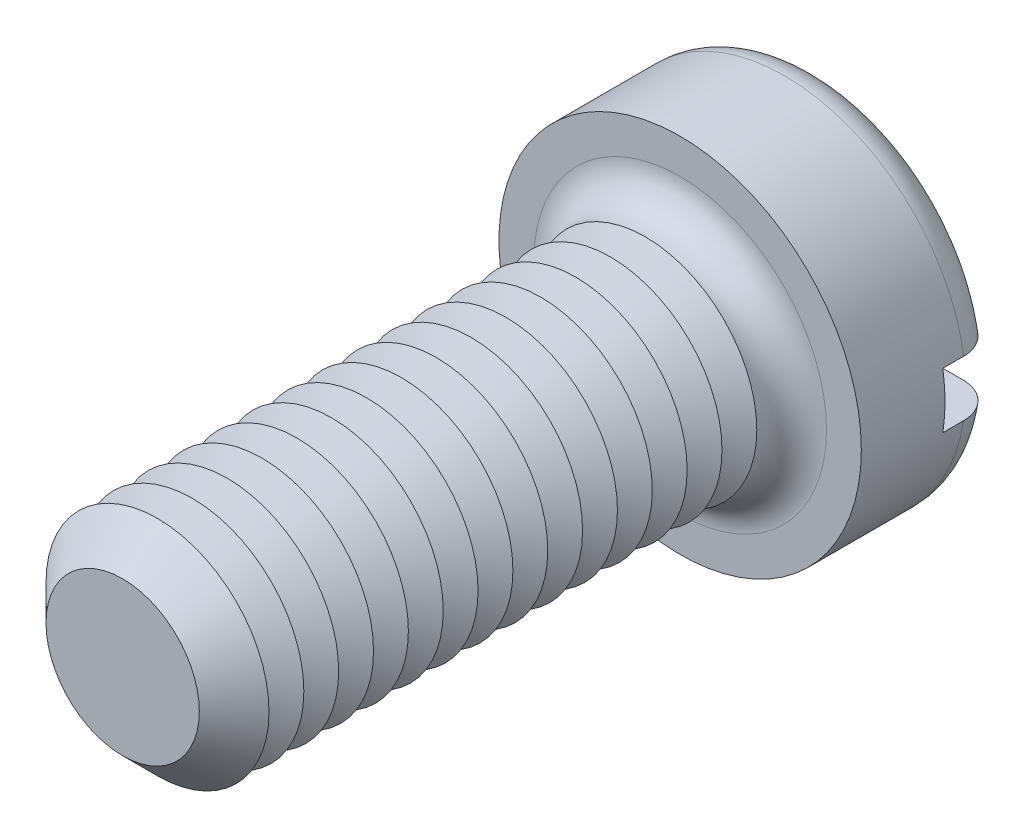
ISO-10303-21;
HEADER;
FILE_DESCRIPTION(('STEP AP214'),'2;1');
FILE_NAME('part.step','',(''),(''),'','','');
FILE_SCHEMA(('AUTOMOTIVE_DESIGN { 1 0 10303 214 1 1 1 1 }'));
ENDSEC;
DATA;
#1=APPLICATION_CONTEXT('core data for automotive mechanical design processes');
#2=APPLICATION_PROTOCOL_DEFINITION('international standard','automotive_design',2000,#1);
#3=PRODUCT_CONTEXT('',#1,'mechanical');
#4=PRODUCT('Part','Part','',(#3));
#5=PRODUCT_RELATED_PRODUCT_CATEGORY('part','',(#4));
#6=PRODUCT_DEFINITION_FORMATION('','',#4);
#7=PRODUCT_DEFINITION_CONTEXT('part definition',#1,'design');
#8=PRODUCT_DEFINITION('design','',#6,#7);
#9=PRODUCT_DEFINITION_SHAPE('','',#8);
#10=(LENGTH_UNIT() NAMED_UNIT(*) SI_UNIT(.MILLI.,.METRE.));
#11=(NAMED_UNIT(*) PLANE_ANGLE_UNIT() SI_UNIT($,.RADIAN.));
#12=(NAMED_UNIT(*) SI_UNIT($,.STERADIAN.) SOLID_ANGLE_UNIT());
#13=UNCERTAINTY_MEASURE_WITH_UNIT(LENGTH_MEASURE(1.E-05),#10,'distance_accuracy_value','');
#14=(GEOMETRIC_REPRESENTATION_CONTEXT(3) GLOBAL_UNCERTAINTY_ASSIGNED_CONTEXT((#13)) GLOBAL_UNIT_ASSIGNED_CONTEXT((#10,
#11,#12)) REPRESENTATION_CONTEXT('',''));
#15=CARTESIAN_POINT('',(0.,0.,0.));
#16=DIRECTION('',(0.,0.,1.));
#17=DIRECTION('',(1.,0.,0.));
#18=AXIS2_PLACEMENT_3D('',#15,#16,#17);
#19=CARTESIAN_POINT('',(0.,0.,-5.));
#20=DIRECTION('',(0.,0.,1.));
#21=DIRECTION('',(1.,0.,0.));
#22=AXIS2_PLACEMENT_3D('',#19,#20,#21);
#23=PLANE('',#22);
#24=CARTESIAN_POINT('',(0.,0.,-5.));
#25=DIRECTION('',(0.,0.,1.));
#26=DIRECTION('',(1.,0.,0.));
#27=AXIS2_PLACEMENT_3D('',#24,#25,#26);
#28=CIRCLE('',#27,5.25);
#29=CARTESIAN_POINT('',(-5.15388203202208,1.,-5.));
#30=VERTEX_POINT('',#29);
#31=CARTESIAN_POINT('',(5.15388203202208,1.,-5.));
#32=VERTEX_POINT('',#31);
#33=EDGE_CURVE('E116',#30,#32,#28,.F.);
#34=ORIENTED_EDGE('',*,*,#33,.T.);
#35=DIRECTION('',(1.,0.,0.));
#36=VECTOR('',#35,1.);
#37=CARTESIAN_POINT('',(-6.5,1.,-5.));
#38=LINE('',#37,#36);
#39=EDGE_CURVE('E111',#30,#32,#38,.T.);
#40=ORIENTED_EDGE('',*,*,#39,.F.);
#41=EDGE_LOOP('',(#34,#40));
#42=FACE_BOUND('',#41,.T.);
#43=ADVANCED_FACE('F39',(#42),#23,.F.);
#44=CARTESIAN_POINT('',(0.,0.,-3.75));
#45=DIRECTION('',(0.,0.,1.));
#46=DIRECTION('',(1.,0.,0.));
#47=AXIS2_PLACEMENT_3D('',#44,#45,#46);
#48=TOROIDAL_SURFACE('',#47,5.25,1.25);
#49=CARTESIAN_POINT('',(-6.04655789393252,1.,-4.63904490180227));
#50=CARTESIAN_POINT('',(-5.99546860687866,1.,-4.68885774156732));
#51=CARTESIAN_POINT('',(-5.94008472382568,1.,-4.73434760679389));
#52=CARTESIAN_POINT('',(-5.8223927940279,1.,-4.81538052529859));
#53=CARTESIAN_POINT('',(-5.7600753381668,1.,-4.85090982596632));
#54=CARTESIAN_POINT('',(-5.63044351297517,1.,-4.91100606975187));
#55=CARTESIAN_POINT('',(-5.56313479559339,1.,-4.93558519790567));
#56=CARTESIAN_POINT('',(-5.42539577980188,1.,-4.97322457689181));
#57=CARTESIAN_POINT('',(-5.35496625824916,1.,-4.98628767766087));
#58=CARTESIAN_POINT('',(-5.21212635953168,1.,-5.00070478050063));
#59=CARTESIAN_POINT('',(-5.13970265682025,1.,-5.00192674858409));
#60=CARTESIAN_POINT('',(-4.99565121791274,1.,-4.99234085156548));
#61=CARTESIAN_POINT('',(-4.92402357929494,1.,-4.98153152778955));
#62=CARTESIAN_POINT('',(-4.78274786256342,1.,-4.94801424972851));
#63=CARTESIAN_POINT('',(-4.71313137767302,1.,-4.92517296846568));
#64=CARTESIAN_POINT('',(-4.57871041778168,1.,-4.86813760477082));
#65=CARTESIAN_POINT('',(-4.51390612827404,1.,-4.83394308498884));
#66=CARTESIAN_POINT('',(-4.39095493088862,1.,-4.75508341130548));
#67=CARTESIAN_POINT('',(-4.33281197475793,1.,-4.7104120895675));
#68=CARTESIAN_POINT('',(-4.22499800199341,1.,-4.61179869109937));
#69=CARTESIAN_POINT('',(-4.17532640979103,1.,-4.55785724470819));
#70=CARTESIAN_POINT('',(-4.08677450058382,1.,-4.4431082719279));
#71=CARTESIAN_POINT('',(-4.0477350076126,1.,-4.38242369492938));
#72=CARTESIAN_POINT('',(-3.98074296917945,1.,-4.25521412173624));
#73=CARTESIAN_POINT('',(-3.95278836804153,1.,-4.18869021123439));
#74=CARTESIAN_POINT('',(-3.90959497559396,1.,-4.0537026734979));
#75=CARTESIAN_POINT('',(-3.89401985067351,1.,-3.98534663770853));
#76=CARTESIAN_POINT('',(-3.8748586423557,1.,-3.84697740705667));
#77=CARTESIAN_POINT('',(-3.87127067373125,1.,-3.7769644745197));
#78=CARTESIAN_POINT('',(-3.8761573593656,1.,-3.63892215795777));
#79=CARTESIAN_POINT('',(-3.88436651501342,1.,-3.57088319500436));
#80=CARTESIAN_POINT('',(-3.91207743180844,1.,-3.43714958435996));
#81=CARTESIAN_POINT('',(-3.93157911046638,1.,-3.37145491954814));
#82=CARTESIAN_POINT('',(-3.98125045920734,1.,-3.24411474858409));
#83=CARTESIAN_POINT('',(-4.01143761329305,1.,-3.18247607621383));
#84=CARTESIAN_POINT('',(-4.08150210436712,1.,-3.064981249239));
#85=CARTESIAN_POINT('',(-4.12138048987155,1.,-3.0091257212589));
#86=CARTESIAN_POINT('',(-4.2106718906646,1.,-2.90336353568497));
#87=CARTESIAN_POINT('',(-4.26028693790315,1.,-2.85362751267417));
#88=CARTESIAN_POINT('',(-4.36696587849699,1.,-2.76291710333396));
#89=CARTESIAN_POINT('',(-4.42403082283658,1.,-2.72194395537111));
#90=CARTESIAN_POINT('',(-4.54567957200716,1.,-2.64877280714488));
#91=CARTESIAN_POINT('',(-4.61042643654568,1.,-2.61684571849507));
#92=CARTESIAN_POINT('',(-4.74430563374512,1.,-2.56412359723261));
#93=CARTESIAN_POINT('',(-4.81343838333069,1.,-2.54332962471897));
#94=CARTESIAN_POINT('',(-4.95527237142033,1.,-2.51320471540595));
#95=CARTESIAN_POINT('',(-5.0280120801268,1.,-2.50405449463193));
#96=CARTESIAN_POINT('',(-5.17399775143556,1.,-2.49810126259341));
#97=CARTESIAN_POINT('',(-5.24724372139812,1.,-2.50129843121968));
#98=CARTESIAN_POINT('',(-5.3921014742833,1.,-2.52000776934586));
#99=CARTESIAN_POINT('',(-5.4637142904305,1.,-2.53551191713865));
#100=CARTESIAN_POINT('',(-5.60326680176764,1.,-2.57846304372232));
#101=CARTESIAN_POINT('',(-5.67120668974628,1.,-2.60590939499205));
#102=CARTESIAN_POINT('',(-5.80064060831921,1.,-2.67164926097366));
#103=CARTESIAN_POINT('',(-5.862199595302,1.,-2.7098148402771));
#104=CARTESIAN_POINT('',(-5.9779079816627,1.,-2.79608690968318));
#105=CARTESIAN_POINT('',(-6.03205795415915,1.,-2.84419263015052));
#106=CARTESIAN_POINT('',(-6.13055119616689,1.,-2.94820522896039));
#107=CARTESIAN_POINT('',(-6.17502887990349,1.,-3.00398483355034));
#108=CARTESIAN_POINT('',(-6.25384180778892,1.,-3.12230113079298));
#109=CARTESIAN_POINT('',(-6.28817779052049,1.,-3.18483733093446));
#110=CARTESIAN_POINT('',(-6.34527986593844,1.,-3.31401726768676));
#111=CARTESIAN_POINT('',(-6.36818984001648,1.,-3.38059742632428));
#112=CARTESIAN_POINT('',(-6.40240470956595,1.,-3.5166725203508));
#113=CARTESIAN_POINT('',(-6.41371067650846,1.,-3.58616718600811));
#114=CARTESIAN_POINT('',(-6.42433240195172,1.,-3.72550026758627));
#115=CARTESIAN_POINT('',(-6.4237441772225,1.,-3.79533138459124));
#116=CARTESIAN_POINT('',(-6.41082814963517,1.,-3.93391789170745));
#117=CARTESIAN_POINT('',(-6.39849757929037,1.,-4.00267302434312));
#118=CARTESIAN_POINT('',(-6.36249191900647,1.,-4.13704597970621));
#119=CARTESIAN_POINT('',(-6.33883072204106,1.,-4.20266753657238));
#120=CARTESIAN_POINT('',(-6.28088769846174,1.,-4.32897165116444));
#121=CARTESIAN_POINT('',(-6.24661890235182,1.,-4.38966015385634));
#122=CARTESIAN_POINT('',(-6.18404039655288,1.,-4.48163773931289));
#123=CARTESIAN_POINT('',(-6.15876600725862,1.,-4.51503333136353));
#124=CARTESIAN_POINT('',(-6.10500607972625,1.,-4.5791298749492));
#125=CARTESIAN_POINT('',(-6.07652056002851,1.,-4.60983084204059));
#126=CARTESIAN_POINT('',(-6.04655789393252,1.,-4.63904490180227));
#127=B_SPLINE_CURVE_WITH_KNOTS('',3,(#49,#50,#51,#52,#53,#54,#55,#56,#57,#58,#59,#60,#61,#62,
#63,#64,#65,#66,#67,#68,#69,#70,#71,#72,#73,#74,#75,#76,#77,#78,#79,#80,#81,#82,#83,#84,#85,#86,
#87,#88,#89,#90,#91,#92,#93,#94,#95,#96,#97,#98,#99,#100,#101,#102,#103,#104,#105,#106,#107,
#108,#109,#110,#111,#112,#113,#114,#115,#116,#117,#118,#119,#120,#121,#122,#123,#124,#125,#126),
.UNSPECIFIED.,.T.,.F.,(4,2,2,2,2,2,2,2,2,2,2,2,2,2,2,2,2,2,2,2,2,2,2,2,2,2,2,2,2,2,2,2,2,2,2,2,
2,2,4),(0.,0.213907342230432,0.428108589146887,0.642070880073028,0.855980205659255,
1.07227200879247,1.28859003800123,1.50735715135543,1.72613269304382,1.94503735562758,
2.16392713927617,2.37933295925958,2.59469881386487,2.80399176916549,3.01325180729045,
3.2178754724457,3.42249764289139,3.62745618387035,3.83243690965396,4.04223444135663,
4.25206160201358,4.46763253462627,4.68322399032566,4.90212226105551,5.12102372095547,
5.33978261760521,5.55853002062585,5.77477015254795,5.99099354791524,6.20398686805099,
6.41696467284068,6.62718821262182,6.83739233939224,7.0459002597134,7.25445733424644,
7.46275934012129,7.67080647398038,7.79625882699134,7.92171045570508),.UNSPECIFIED.);
#128=CARTESIAN_POINT('',(-6.42261628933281,1.,-3.74999999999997));
#129=VERTEX_POINT('',#128);
#130=EDGE_CURVE('E291',#129,#30,#127,.T.);
#131=ORIENTED_EDGE('',*,*,#130,.F.);
#132=CARTESIAN_POINT('',(0.,0.,-3.75));
#133=DIRECTION('',(0.,0.,1.));
#134=DIRECTION('',(1.,0.,0.));
#135=AXIS2_PLACEMENT_3D('',#132,#133,#134);
#136=CIRCLE('',#135,6.5);
#137=CARTESIAN_POINT('',(6.42261628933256,1.,-3.75));
#138=VERTEX_POINT('',#137);
#139=EDGE_CURVE('E125',#138,#129,#136,.T.);
#140=ORIENTED_EDGE('',*,*,#139,.F.);
#141=CARTESIAN_POINT('',(4.06944999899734,1.,-4.4133199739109));
#142=CARTESIAN_POINT('',(4.10828271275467,1.,-4.47354709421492));
#143=CARTESIAN_POINT('',(4.15233880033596,1.,-4.53047894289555));
#144=CARTESIAN_POINT('',(4.24946916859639,1.,-4.63614530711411));
#145=CARTESIAN_POINT('',(4.3025574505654,1.,-4.68486685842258));
#146=CARTESIAN_POINT('',(4.41603250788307,1.,-4.77271114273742));
#147=CARTESIAN_POINT('',(4.47640839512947,1.,-4.8118479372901));
#148=CARTESIAN_POINT('',(4.60277035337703,1.,-4.87959878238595));
#149=CARTESIAN_POINT('',(4.66875480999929,1.,-4.90821584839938));
#150=CARTESIAN_POINT('',(4.80558589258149,1.,-4.95456537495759));
#151=CARTESIAN_POINT('',(4.87649196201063,1.,-4.97212253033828));
#152=CARTESIAN_POINT('',(5.02024710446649,1.,-4.99514979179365));
#153=CARTESIAN_POINT('',(5.09309636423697,1.,-5.00061873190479));
#154=CARTESIAN_POINT('',(5.23902872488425,1.,-4.99926689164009));
#155=CARTESIAN_POINT('',(5.31211131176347,1.,-4.99238812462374));
#156=CARTESIAN_POINT('',(5.45605806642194,1.,-4.96635140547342));
#157=CARTESIAN_POINT('',(5.52692231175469,1.,-4.94719388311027));
#158=CARTESIAN_POINT('',(5.66376170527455,1.,-4.89728421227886));
#159=CARTESIAN_POINT('',(5.72977335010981,1.,-4.86663219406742));
#160=CARTESIAN_POINT('',(5.85560715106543,1.,-4.79452334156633));
#161=CARTESIAN_POINT('',(5.91542977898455,1.,-4.7530673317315));
#162=CARTESIAN_POINT('',(6.02626022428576,1.,-4.66116821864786));
#163=CARTESIAN_POINT('',(6.07738307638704,1.,-4.6108638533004));
#164=CARTESIAN_POINT('',(6.17030947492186,1.,-4.50227823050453));
#165=CARTESIAN_POINT('',(6.2121137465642,1.,-4.44399759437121));
#166=CARTESIAN_POINT('',(6.28460268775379,1.,-4.32200305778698));
#167=CARTESIAN_POINT('',(6.31543589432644,1.,-4.2583773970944));
#168=CARTESIAN_POINT('',(6.36586009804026,1.,-4.12681721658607));
#169=CARTESIAN_POINT('',(6.38545178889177,1.,-4.0588829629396));
#170=CARTESIAN_POINT('',(6.41265760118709,1.,-3.92136007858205));
#171=CARTESIAN_POINT('',(6.42038873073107,1.,-3.85179457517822));
#172=CARTESIAN_POINT('',(6.42401070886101,1.,-3.7123569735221));
#173=CARTESIAN_POINT('',(6.41990193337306,1.,-3.64248488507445));
#174=CARTESIAN_POINT('',(6.40000894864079,1.,-3.50470871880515));
#175=CARTESIAN_POINT('',(6.38427119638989,1.,-3.43679792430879));
#176=CARTESIAN_POINT('',(6.34164491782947,1.,-3.30457296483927));
#177=CARTESIAN_POINT('',(6.31475638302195,1.,-3.24025880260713));
#178=CARTESIAN_POINT('',(6.2505455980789,1.,-3.11686791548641));
#179=CARTESIAN_POINT('',(6.21319759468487,1.,-3.05780459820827));
#180=CARTESIAN_POINT('',(6.12919411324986,1.,-2.94671919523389));
#181=CARTESIAN_POINT('',(6.08253833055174,1.,-2.89469734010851));
#182=CARTESIAN_POINT('',(5.98083387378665,1.,-2.79868150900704));
#183=CARTESIAN_POINT('',(5.92571704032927,1.,-2.75475975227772));
#184=CARTESIAN_POINT('',(5.80897194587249,1.,-2.67665277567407));
#185=CARTESIAN_POINT('',(5.74734329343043,1.,-2.64246814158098));
#186=CARTESIAN_POINT('',(5.6184644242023,1.,-2.58431810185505));
#187=CARTESIAN_POINT('',(5.55115102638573,1.,-2.56049275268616));
#188=CARTESIAN_POINT('',(5.41351272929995,1.,-2.52429868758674));
#189=CARTESIAN_POINT('',(5.34318759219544,1.,-2.51193087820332));
#190=CARTESIAN_POINT('',(5.20041507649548,1.,-2.49882112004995));
#191=CARTESIAN_POINT('',(5.12795169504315,1.,-2.49825332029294));
#192=CARTESIAN_POINT('',(4.98393373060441,1.,-2.50914771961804));
#193=CARTESIAN_POINT('',(4.91237921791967,1.,-2.52061084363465));
#194=CARTESIAN_POINT('',(4.77137358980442,1.,-2.55542281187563));
#195=CARTESIAN_POINT('',(4.70195472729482,1.,-2.57890245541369));
#196=CARTESIAN_POINT('',(4.56803538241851,1.,-2.63717701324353));
#197=CARTESIAN_POINT('',(4.50353509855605,1.,-2.67197238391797));
#198=CARTESIAN_POINT('',(4.38131858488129,1.,-2.7519648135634));
#199=CARTESIAN_POINT('',(4.32360365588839,1.,-2.79716386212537));
#200=CARTESIAN_POINT('',(4.21673400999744,1.,-2.89675634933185));
#201=CARTESIAN_POINT('',(4.16757871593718,1.,-2.95114916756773));
#202=CARTESIAN_POINT('',(4.08014713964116,1.,-3.06667703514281));
#203=CARTESIAN_POINT('',(4.04170608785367,1.,-3.12768727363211));
#204=CARTESIAN_POINT('',(3.97596192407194,1.,-3.25543782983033));
#205=CARTESIAN_POINT('',(3.94865624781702,1.,-3.32217682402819));
#206=CARTESIAN_POINT('',(3.9067737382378,1.,-3.45745603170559));
#207=CARTESIAN_POINT('',(3.89185707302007,1.,-3.52589108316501));
#208=CARTESIAN_POINT('',(3.87400755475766,1.,-3.66432360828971));
#209=CARTESIAN_POINT('',(3.87107601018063,1.,-3.73432125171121));
#210=CARTESIAN_POINT('',(3.8772387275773,1.,-3.87228267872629));
#211=CARTESIAN_POINT('',(3.88607933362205,1.,-3.94025811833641));
#212=CARTESIAN_POINT('',(3.91502769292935,1.,-4.07370133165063));
#213=CARTESIAN_POINT('',(3.93512131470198,1.,-4.1391721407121));
#214=CARTESIAN_POINT('',(3.9752037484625,1.,-4.23926719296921));
#215=CARTESIAN_POINT('',(3.99171171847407,1.,-4.27532618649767));
#216=CARTESIAN_POINT('',(4.02809737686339,1.,-4.34569933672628));
#217=CARTESIAN_POINT('',(4.04797497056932,1.,-4.3800135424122));
#218=CARTESIAN_POINT('',(4.06944999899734,1.,-4.4133199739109));
#219=B_SPLINE_CURVE_WITH_KNOTS('',3,(#141,#142,#143,#144,#145,#146,#147,#148,#149,#150,#151,
#152,#153,#154,#155,#156,#157,#158,#159,#160,#161,#162,#163,#164,#165,#166,#167,#168,#169,#170,
#171,#172,#173,#174,#175,#176,#177,#178,#179,#180,#181,#182,#183,#184,#185,#186,#187,#188,#189,
#190,#191,#192,#193,#194,#195,#196,#197,#198,#199,#200,#201,#202,#203,#204,#205,#206,#207,#208,
#209,#210,#211,#212,#213,#214,#215,#216,#217,#218),.UNSPECIFIED.,.T.,.F.,(4,2,2,2,2,2,2,2,2,2,2,
2,2,2,2,2,2,2,2,2,2,2,2,2,2,2,2,2,2,2,2,2,2,2,2,2,2,2,4),(0.,0.214833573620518,
0.430003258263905,0.644855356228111,0.859645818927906,1.0777603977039,1.29589601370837,
1.51505870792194,1.73421373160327,1.95150241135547,2.16877451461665,2.38290237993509,
2.59701357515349,2.8081044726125,3.01918234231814,3.22816416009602,3.43713934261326,
3.64528416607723,3.85342914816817,4.06209119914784,4.27076008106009,4.48120788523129,
4.69166834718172,4.90489186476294,5.11813225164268,5.33451752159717,5.55091942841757,
5.76972860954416,5.98854661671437,6.20740650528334,6.42625163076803,6.64151774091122,
6.85673425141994,7.0658317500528,7.27495207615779,7.47963858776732,7.68406862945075,
7.80287790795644,7.92168384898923),.UNSPECIFIED.);
#220=EDGE_CURVE('E293',#32,#138,#219,.T.);
#221=ORIENTED_EDGE('',*,*,#220,.F.);
#222=ORIENTED_EDGE('',*,*,#33,.F.);
#223=EDGE_LOOP('',(#131,#140,#221,#222));
#224=FACE_BOUND('',#223,.T.);
#225=ADVANCED_FACE('F275',(#224),#48,.T.);
#226=CARTESIAN_POINT('',(0.,0.,-5.));
#227=DIRECTION('',(0.,0.,1.));
#228=DIRECTION('',(1.,0.,0.));
#229=AXIS2_PLACEMENT_3D('',#226,#227,#228);
#230=CYLINDRICAL_SURFACE('',#229,6.5);
#231=DIRECTION('',(0.,0.,1.));
#232=VECTOR('',#231,1.);
#233=CARTESIAN_POINT('',(6.42261628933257,1.,-5.));
#234=LINE('',#233,#232);
#235=CARTESIAN_POINT('',(6.42261628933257,1.,-3.));
#236=VERTEX_POINT('',#235);
#237=EDGE_CURVE('E308',#138,#236,#234,.T.);
#238=ORIENTED_EDGE('',*,*,#237,.F.);
#239=ORIENTED_EDGE('',*,*,#139,.T.);
#240=DIRECTION('',(0.,0.,1.));
#241=VECTOR('',#240,1.);
#242=CARTESIAN_POINT('',(-6.42261628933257,1.,-5.));
#243=LINE('',#242,#241);
#244=CARTESIAN_POINT('',(-6.42261628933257,1.,-3.));
#245=VERTEX_POINT('',#244);
#246=EDGE_CURVE('E63',#245,#129,#243,.F.);
#247=ORIENTED_EDGE('',*,*,#246,.F.);
#248=CARTESIAN_POINT('',(0.,0.,-3.));
#249=DIRECTION('',(0.,0.,-1.));
#250=DIRECTION('',(-1.,0.,0.));
#251=AXIS2_PLACEMENT_3D('',#248,#249,#250);
#252=CIRCLE('',#251,6.5);
#253=CARTESIAN_POINT('',(-6.42261628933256,-0.999999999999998,-3.));
#254=VERTEX_POINT('',#253);
#255=EDGE_CURVE('E43',#245,#254,#252,.F.);
#256=ORIENTED_EDGE('',*,*,#255,.T.);
#257=DIRECTION('',(0.,0.,1.));
#258=VECTOR('',#257,1.);
#259=CARTESIAN_POINT('',(-6.42261628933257,-0.999999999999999,-5.));
#260=LINE('',#259,#258);
#261=CARTESIAN_POINT('',(-6.42261628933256,-0.999999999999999,-3.75));
#262=VERTEX_POINT('',#261);
#263=EDGE_CURVE('E305',#262,#254,#260,.T.);
#264=ORIENTED_EDGE('',*,*,#263,.F.);
#265=CARTESIAN_POINT('',(6.42261628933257,-1.,-3.75));
#266=VERTEX_POINT('',#265);
#267=EDGE_CURVE('E127',#262,#266,#136,.T.);
#268=ORIENTED_EDGE('',*,*,#267,.T.);
#269=DIRECTION('',(0.,0.,1.));
#270=VECTOR('',#269,1.);
#271=CARTESIAN_POINT('',(6.42261628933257,-1.,-5.));
#272=LINE('',#271,#270);
#273=CARTESIAN_POINT('',(6.42261628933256,-1.,-3.));
#274=VERTEX_POINT('',#273);
#275=EDGE_CURVE('E55',#274,#266,#272,.F.);
#276=ORIENTED_EDGE('',*,*,#275,.F.);
#277=EDGE_CURVE('E11',#274,#236,#252,.F.);
#278=ORIENTED_EDGE('',*,*,#277,.T.);
#279=EDGE_LOOP('',(#238,#239,#247,#256,#264,#268,#276,#278));
#280=FACE_BOUND('',#279,.T.);
#281=CARTESIAN_POINT('',(0.,0.,0.));
#282=DIRECTION('',(0.,0.,1.));
#283=DIRECTION('',(1.,0.,0.));
#284=AXIS2_PLACEMENT_3D('',#281,#282,#283);
#285=CIRCLE('',#284,6.5);
#286=CARTESIAN_POINT('',(6.5,0.,0.));
#287=VERTEX_POINT('',#286);
#288=EDGE_CURVE('E311',#287,#287,#285,.T.);
#289=ORIENTED_EDGE('',*,*,#288,.F.);
#290=EDGE_LOOP('',(#289));
#291=FACE_BOUND('',#290,.T.);
#292=ADVANCED_FACE('F271',(#280,#291),#230,.T.);
#293=CARTESIAN_POINT('',(5.15388203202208,-1.,-5.));
#294=VERTEX_POINT('',#293);
#295=CARTESIAN_POINT('',(-5.15388203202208,-0.999999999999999,-5.));
#296=VERTEX_POINT('',#295);
#297=EDGE_CURVE('E109',#294,#296,#28,.F.);
#298=ORIENTED_EDGE('',*,*,#297,.T.);
#299=DIRECTION('',(-1.,0.,0.));
#300=VECTOR('',#299,1.);
#301=CARTESIAN_POINT('',(-6.5,-0.999999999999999,-5.));
#302=LINE('',#301,#300);
#303=EDGE_CURVE('E96',#294,#296,#302,.T.);
#304=ORIENTED_EDGE('',*,*,#303,.F.);
#305=EDGE_LOOP('',(#298,#304));
#306=FACE_BOUND('',#305,.T.);
#307=ADVANCED_FACE('F108',(#306),#23,.F.);
#308=CARTESIAN_POINT('',(0.,0.,0.));
#309=DIRECTION('',(0.,0.,1.));
#310=DIRECTION('',(1.,0.,0.));
#311=AXIS2_PLACEMENT_3D('',#308,#309,#310);
#312=PLANE('',#311);
#313=CARTESIAN_POINT('',(0.,0.,0.));
#314=DIRECTION('',(0.,0.,1.));
#315=DIRECTION('',(1.,0.,0.));
#316=AXIS2_PLACEMENT_3D('',#313,#314,#315);
#317=CIRCLE('',#316,5.25);
#318=CARTESIAN_POINT('',(5.25,0.,0.));
#319=VERTEX_POINT('',#318);
#320=EDGE_CURVE('E115',#319,#319,#317,.F.);
#321=ORIENTED_EDGE('',*,*,#320,.T.);
#322=EDGE_LOOP('',(#321));
#323=FACE_BOUND('',#322,.T.);
#324=ORIENTED_EDGE('',*,*,#288,.T.);
#325=EDGE_LOOP('',(#324));
#326=FACE_BOUND('',#325,.T.);
#327=ADVANCED_FACE('F270',(#323,#326),#312,.T.);
#328=CARTESIAN_POINT('',(-6.04655789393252,-0.999999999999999,-4.63904490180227));
#329=CARTESIAN_POINT('',(-6.0966604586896,-0.999999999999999,-4.59018532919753));
#330=CARTESIAN_POINT('',(-6.14270501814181,-0.999999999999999,-4.53709744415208));
#331=CARTESIAN_POINT('',(-6.22528519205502,-0.999999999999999,-4.42391631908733));
#332=CARTESIAN_POINT('',(-6.26181074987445,-0.999999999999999,-4.36381576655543));
#333=CARTESIAN_POINT('',(-6.32422109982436,-0.999999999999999,-4.23831836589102));
#334=CARTESIAN_POINT('',(-6.35010658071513,-0.999999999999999,-4.17292186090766));
#335=CARTESIAN_POINT('',(-6.39044668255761,-0.999999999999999,-4.03870925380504));
#336=CARTESIAN_POINT('',(-6.40490396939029,-0.999999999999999,-3.96989395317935));
#337=CARTESIAN_POINT('',(-6.42190814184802,-0.999999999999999,-3.83122595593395));
#338=CARTESIAN_POINT('',(-6.4245257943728,-0.999999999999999,-3.76138193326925));
#339=CARTESIAN_POINT('',(-6.41796432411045,-0.999999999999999,-3.62224935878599));
#340=CARTESIAN_POINT('',(-6.40878509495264,-0.999999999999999,-3.55296081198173));
#341=CARTESIAN_POINT('',(-6.37894560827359,-0.999999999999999,-3.41709241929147));
#342=CARTESIAN_POINT('',(-6.35831520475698,-0.999999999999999,-3.35050601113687));
#343=CARTESIAN_POINT('',(-6.30620980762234,-0.999999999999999,-3.22172312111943));
#344=CARTESIAN_POINT('',(-6.2747347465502,-0.999999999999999,-3.15952666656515));
#345=CARTESIAN_POINT('',(-6.20172710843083,-0.999999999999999,-3.04101762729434));
#346=CARTESIAN_POINT('',(-6.16015622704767,-0.999999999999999,-2.98472864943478));
#347=CARTESIAN_POINT('',(-6.06823774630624,-0.999999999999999,-2.87984578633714));
#348=CARTESIAN_POINT('',(-6.01788981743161,-0.999999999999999,-2.83125219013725));
#349=CARTESIAN_POINT('',(-5.90933830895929,-0.999999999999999,-2.74262118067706));
#350=CARTESIAN_POINT('',(-5.85106338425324,-0.999999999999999,-2.70267117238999));
#351=CARTESIAN_POINT('',(-5.72870702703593,-0.999999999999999,-2.63296796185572));
#352=CARTESIAN_POINT('',(-5.66462521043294,-0.999999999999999,-2.6032154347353));
#353=CARTESIAN_POINT('',(-5.53153273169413,-0.999999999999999,-2.55430842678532));
#354=CARTESIAN_POINT('',(-5.46246626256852,-0.999999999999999,-2.53530583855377));
#355=CARTESIAN_POINT('',(-5.32214267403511,-0.999999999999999,-2.5089831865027));
#356=CARTESIAN_POINT('',(-5.25088537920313,-0.999999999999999,-2.50166406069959));
#357=CARTESIAN_POINT('',(-5.10710123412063,-0.999999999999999,-2.49882202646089));
#358=CARTESIAN_POINT('',(-5.03457095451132,-0.999999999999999,-2.50347166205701));
#359=CARTESIAN_POINT('',(-4.8912897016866,-0.999999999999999,-2.52476029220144));
#360=CARTESIAN_POINT('',(-4.82053886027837,-0.999999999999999,-2.54140017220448));
#361=CARTESIAN_POINT('',(-4.68213257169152,-0.999999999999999,-2.58641614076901));
#362=CARTESIAN_POINT('',(-4.61451256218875,-0.999999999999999,-2.61490131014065));
#363=CARTESIAN_POINT('',(-4.48502801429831,-0.999999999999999,-2.68285095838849));
#364=CARTESIAN_POINT('',(-4.42316359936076,-0.999999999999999,-2.72231567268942));
#365=CARTESIAN_POINT('',(-4.30720694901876,-0.999999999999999,-2.81103994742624));
#366=CARTESIAN_POINT('',(-4.25309118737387,-0.999999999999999,-2.86026872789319));
#367=CARTESIAN_POINT('',(-4.15409408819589,-0.999999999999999,-2.9672764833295));
#368=CARTESIAN_POINT('',(-4.10921182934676,-0.999999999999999,-3.02505460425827));
#369=CARTESIAN_POINT('',(-4.03096584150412,-0.999999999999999,-3.14632492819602));
#370=CARTESIAN_POINT('',(-3.99739097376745,-0.999999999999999,-3.2096807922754));
#371=CARTESIAN_POINT('',(-3.94171839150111,-0.999999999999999,-3.34124912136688));
#372=CARTESIAN_POINT('',(-3.91961840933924,-0.999999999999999,-3.40946062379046));
#373=CARTESIAN_POINT('',(-3.88816636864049,-0.999999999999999,-3.54669256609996));
#374=CARTESIAN_POINT('',(-3.87846562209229,-0.999999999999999,-3.61563318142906));
#375=CARTESIAN_POINT('',(-3.87100568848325,-0.999999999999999,-3.75415397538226));
#376=CARTESIAN_POINT('',(-3.87324501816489,-0.999999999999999,-3.82373407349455));
#377=CARTESIAN_POINT('',(-3.88943589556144,-0.999999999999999,-3.96027701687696));
#378=CARTESIAN_POINT('',(-3.90318225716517,-0.999999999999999,-4.0272643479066));
#379=CARTESIAN_POINT('',(-3.94163954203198,-0.999999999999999,-4.1580093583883));
#380=CARTESIAN_POINT('',(-3.96635075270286,-0.999999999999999,-4.22176695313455));
#381=CARTESIAN_POINT('',(-4.026160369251,-0.999999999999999,-4.34483320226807));
#382=CARTESIAN_POINT('',(-4.06134035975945,-0.999999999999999,-4.40410214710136));
#383=CARTESIAN_POINT('',(-4.14090865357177,-0.999999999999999,-4.51609417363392));
#384=CARTESIAN_POINT('',(-4.18529811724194,-0.999999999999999,-4.56881642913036));
#385=CARTESIAN_POINT('',(-4.2832649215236,-0.999999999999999,-4.66770177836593));
#386=CARTESIAN_POINT('',(-4.33705327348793,-0.999999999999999,-4.71365579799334));
#387=CARTESIAN_POINT('',(-4.45141776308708,-0.999999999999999,-4.79615385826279));
#388=CARTESIAN_POINT('',(-4.51199483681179,-0.999999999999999,-4.83269659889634));
#389=CARTESIAN_POINT('',(-4.63989216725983,-0.999999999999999,-4.89626962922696));
#390=CARTESIAN_POINT('',(-4.70734508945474,-0.999999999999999,-4.92303326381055));
#391=CARTESIAN_POINT('',(-4.84575497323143,-0.999999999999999,-4.96500199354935));
#392=CARTESIAN_POINT('',(-4.91671207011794,-0.999999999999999,-4.98020664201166));
#393=CARTESIAN_POINT('',(-5.06097761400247,-0.999999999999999,-4.9987306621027));
#394=CARTESIAN_POINT('',(-5.13430353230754,-0.999999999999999,-5.00191441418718));
#395=CARTESIAN_POINT('',(-5.28046546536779,-0.999999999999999,-4.99587686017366));
#396=CARTESIAN_POINT('',(-5.35330135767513,-0.999999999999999,-4.98665256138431));
#397=CARTESIAN_POINT('',(-5.49610354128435,-0.999999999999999,-4.95604184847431));
#398=CARTESIAN_POINT('',(-5.56607890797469,-0.999999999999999,-4.93469772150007));
#399=CARTESIAN_POINT('',(-5.70131538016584,-0.999999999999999,-4.88041956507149));
#400=CARTESIAN_POINT('',(-5.76658233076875,-0.999999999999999,-4.84750021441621));
#401=CARTESIAN_POINT('',(-5.86782577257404,-0.999999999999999,-4.78498748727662));
#402=CARTESIAN_POINT('',(-5.90579749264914,-0.999999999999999,-4.75856648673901));
#403=CARTESIAN_POINT('',(-5.97862186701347,-0.999999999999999,-4.70172646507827));
#404=CARTESIAN_POINT('',(-6.0134745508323,-0.999999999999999,-4.6713074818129));
#405=CARTESIAN_POINT('',(-6.04655789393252,-0.999999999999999,-4.63904490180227));
#406=B_SPLINE_CURVE_WITH_KNOTS('',3,(#328,#329,#330,#331,#332,#333,#334,#335,#336,#337,#338,
#339,#340,#341,#342,#343,#344,#345,#346,#347,#348,#349,#350,#351,#352,#353,#354,#355,#356,#357,
#358,#359,#360,#361,#362,#363,#364,#365,#366,#367,#368,#369,#370,#371,#372,#373,#374,#375,#376,
#377,#378,#379,#380,#381,#382,#383,#384,#385,#386,#387,#388,#389,#390,#391,#392,#393,#394,#395,
#396,#397,#398,#399,#400,#401,#402,#403,#404,#405),.UNSPECIFIED.,.T.,.F.,(4,2,2,2,2,2,2,2,2,2,2,
2,2,2,2,2,2,2,2,2,2,2,2,2,2,2,2,2,2,2,2,2,2,2,2,2,2,2,4),(0.,0.209780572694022,
0.419781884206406,0.629769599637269,0.839708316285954,1.04839053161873,1.2570746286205,
1.46521720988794,1.67336108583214,1.88230736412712,2.09126148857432,2.30223890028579,
2.51323027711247,2.72713284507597,2.94105258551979,3.15807345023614,3.37511034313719,
3.59419176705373,3.81327788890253,4.03168404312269,4.25006839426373,4.46411376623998,
4.67811682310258,4.88595885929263,5.09377507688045,5.29796268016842,5.50215563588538,
5.70798353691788,5.91383738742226,6.12510741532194,6.33640661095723,6.55309998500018,
6.76980173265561,6.98894112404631,7.20813337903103,7.42656551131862,7.64472163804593,
7.78324365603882,7.92176436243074),.UNSPECIFIED.);
#407=EDGE_CURVE('E103',#296,#262,#406,.T.);
#408=ORIENTED_EDGE('',*,*,#407,.F.);
#409=ORIENTED_EDGE('',*,*,#297,.F.);
#410=CARTESIAN_POINT('',(4.06944999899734,-1.,-4.4133199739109));
#411=CARTESIAN_POINT('',(4.03213207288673,-1.,-4.3554312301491));
#412=CARTESIAN_POINT('',(3.9995849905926,-1.,-4.29441722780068));
#413=CARTESIAN_POINT('',(3.94511822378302,-1.,-4.16776604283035));
#414=CARTESIAN_POINT('',(3.92320762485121,-1.,-4.10212496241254));
#415=CARTESIAN_POINT('',(3.89078811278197,-1.,-3.96804412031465));
#416=CARTESIAN_POINT('',(3.88028409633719,-1.,-3.89960316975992));
#417=CARTESIAN_POINT('',(3.87107895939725,-1.,-3.76194650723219));
#418=CARTESIAN_POINT('',(3.87237511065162,-1.,-3.69273097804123));
#419=CARTESIAN_POINT('',(3.88662927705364,-1.,-3.55634460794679));
#420=CARTESIAN_POINT('',(3.89944923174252,-1.,-3.48915926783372));
#421=CARTESIAN_POINT('',(3.93611188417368,-1.,-3.35786953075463));
#422=CARTESIAN_POINT('',(3.95995518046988,-1.,-3.29376530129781));
#423=CARTESIAN_POINT('',(4.0180748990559,-1.,-3.16993562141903));
#424=CARTESIAN_POINT('',(4.05242297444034,-1.,-3.11024385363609));
#425=CARTESIAN_POINT('',(4.13041121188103,-1.,-2.9972793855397));
#426=CARTESIAN_POINT('',(4.17405248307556,-1.,-2.94400745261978));
#427=CARTESIAN_POINT('',(4.27058636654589,-1.,-2.8439150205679));
#428=CARTESIAN_POINT('',(4.32368948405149,-1.,-2.79729757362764));
#429=CARTESIAN_POINT('',(4.43679856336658,-1.,-2.71336600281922));
#430=CARTESIAN_POINT('',(4.49680546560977,-1.,-2.67605314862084));
#431=CARTESIAN_POINT('',(4.62370121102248,-1.,-2.61081752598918));
#432=CARTESIAN_POINT('',(4.69072799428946,-1.,-2.58316284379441));
#433=CARTESIAN_POINT('',(4.82843981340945,-1.,-2.5393441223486));
#434=CARTESIAN_POINT('',(4.899125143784,-1.,-2.52318100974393));
#435=CARTESIAN_POINT('',(5.04306377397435,-1.,-2.50267755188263));
#436=CARTESIAN_POINT('',(5.11633773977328,-1.,-2.49848181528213));
#437=CARTESIAN_POINT('',(5.26254809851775,-1.,-2.50249357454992));
#438=CARTESIAN_POINT('',(5.33548449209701,-1.,-2.51070104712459));
#439=CARTESIAN_POINT('',(5.4786703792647,-1.,-2.53930888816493));
#440=CARTESIAN_POINT('',(5.54892819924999,-1.,-2.5596675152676));
#441=CARTESIAN_POINT('',(5.68495799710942,-1.,-2.61204238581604));
#442=CARTESIAN_POINT('',(5.75073024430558,-1.,-2.64405792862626));
#443=CARTESIAN_POINT('',(5.8750178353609,-1.,-2.7184150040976));
#444=CARTESIAN_POINT('',(5.93361487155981,-1.,-2.76061995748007));
#445=CARTESIAN_POINT('',(6.04275377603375,-1.,-2.85440601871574));
#446=CARTESIAN_POINT('',(6.09329629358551,-1.,-2.90598637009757));
#447=CARTESIAN_POINT('',(6.18409572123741,-1.,-3.01622977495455));
#448=CARTESIAN_POINT('',(6.2244945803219,-1.,-3.07477592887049));
#449=CARTESIAN_POINT('',(6.29474798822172,-1.,-3.19788594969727));
#450=CARTESIAN_POINT('',(6.3246032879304,-1.,-3.26244938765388));
#451=CARTESIAN_POINT('',(6.37256001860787,-1.,-3.39491634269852));
#452=CARTESIAN_POINT('',(6.39079949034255,-1.,-3.46276990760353));
#453=CARTESIAN_POINT('',(6.41554133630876,-1.,-3.60058363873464));
#454=CARTESIAN_POINT('',(6.42204424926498,-1.,-3.67054370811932));
#455=CARTESIAN_POINT('',(6.42311237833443,-1.,-3.81007982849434));
#456=CARTESIAN_POINT('',(6.41775799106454,-1.,-3.879655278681));
#457=CARTESIAN_POINT('',(6.39543799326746,-1.,-4.01691664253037));
#458=CARTESIAN_POINT('',(6.3784725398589,-1.,-4.08460258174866));
#459=CARTESIAN_POINT('',(6.33344768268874,-1.,-4.21614537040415));
#460=CARTESIAN_POINT('',(6.30539273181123,-1.,-4.28000374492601));
#461=CARTESIAN_POINT('',(6.23902076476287,-1.,-4.40214140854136));
#462=CARTESIAN_POINT('',(6.20070356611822,-1.,-4.46042059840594));
#463=CARTESIAN_POINT('',(6.11467174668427,-1.,-4.5701315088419));
#464=CARTESIAN_POINT('',(6.06690270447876,-1.,-4.62152053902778));
#465=CARTESIAN_POINT('',(5.96350111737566,-1.,-4.715657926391));
#466=CARTESIAN_POINT('',(5.90786817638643,-1.,-4.75840584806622));
#467=CARTESIAN_POINT('',(5.78965380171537,-1.,-4.8345781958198));
#468=CARTESIAN_POINT('',(5.72700078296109,-1.,-4.86789149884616));
#469=CARTESIAN_POINT('',(5.59704977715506,-1.,-4.92369754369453));
#470=CARTESIAN_POINT('',(5.52975144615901,-1.,-4.94618948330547));
#471=CARTESIAN_POINT('',(5.39137621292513,-1.,-4.98006173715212));
#472=CARTESIAN_POINT('',(5.32025859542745,-1.,-4.99127571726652));
#473=CARTESIAN_POINT('',(5.17715081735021,-1.,-5.00177798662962));
#474=CARTESIAN_POINT('',(5.10516061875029,-1.,-5.00106575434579));
#475=CARTESIAN_POINT('',(4.96131924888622,-1.,-4.98769775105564));
#476=CARTESIAN_POINT('',(4.88948297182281,-1.,-4.97488146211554));
#477=CARTESIAN_POINT('',(4.74893184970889,-1.,-4.93744335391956));
#478=CARTESIAN_POINT('',(4.68021795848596,-1.,-4.91281795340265));
#479=CARTESIAN_POINT('',(4.54744428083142,-1.,-4.8522329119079));
#480=CARTESIAN_POINT('',(4.48341761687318,-1.,-4.81620070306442));
#481=CARTESIAN_POINT('',(4.36244497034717,-1.,-4.73383277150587));
#482=CARTESIAN_POINT('',(4.30549069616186,-1.,-4.68750929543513));
#483=CARTESIAN_POINT('',(4.21823158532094,-1.,-4.60311228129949));
#484=CARTESIAN_POINT('',(4.18544074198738,-1.,-4.56757118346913));
#485=CARTESIAN_POINT('',(4.12413461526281,-1.,-4.49297229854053));
#486=CARTESIAN_POINT('',(4.09561926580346,-1.,-4.45391456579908));
#487=CARTESIAN_POINT('',(4.06944999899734,-1.,-4.4133199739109));
#488=B_SPLINE_CURVE_WITH_KNOTS('',3,(#410,#411,#412,#413,#414,#415,#416,#417,#418,#419,#420,
#421,#422,#423,#424,#425,#426,#427,#428,#429,#430,#431,#432,#433,#434,#435,#436,#437,#438,#439,
#440,#441,#442,#443,#444,#445,#446,#447,#448,#449,#450,#451,#452,#453,#454,#455,#456,#457,#458,
#459,#460,#461,#462,#463,#464,#465,#466,#467,#468,#469,#470,#471,#472,#473,#474,#475,#476,#477,
#478,#479,#480,#481,#482,#483,#484,#485,#486,#487),.UNSPECIFIED.,.T.,.F.,(4,2,2,2,2,2,2,2,2,2,2,
2,2,2,2,2,2,2,2,2,2,2,2,2,2,2,2,2,2,2,2,2,2,2,2,2,2,2,4),(0.,0.206453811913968,0.4130836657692,
0.619802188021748,0.826472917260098,1.03070015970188,1.23493849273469,1.44060223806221,
1.64629054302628,1.85731119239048,2.06836062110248,2.28487349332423,2.5014038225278,
2.72053974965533,2.9396752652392,3.15806230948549,3.37643622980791,3.59203140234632,
3.80760918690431,4.01997696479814,4.23232961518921,4.44210913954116,4.65187903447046,
4.86023097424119,5.06858009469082,5.27684563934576,5.48511488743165,5.69462015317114,
5.90413597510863,6.11602561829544,6.32793096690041,6.54291770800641,6.75791385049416,
6.97580180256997,7.19375587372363,7.41312537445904,7.63223520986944,7.77701357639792,
7.92178970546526),.UNSPECIFIED.);
#489=EDGE_CURVE('E92',#266,#294,#488,.T.);
#490=ORIENTED_EDGE('',*,*,#489,.F.);
#491=ORIENTED_EDGE('',*,*,#267,.F.);
#492=EDGE_LOOP('',(#408,#409,#490,#491));
#493=FACE_BOUND('',#492,.T.);
#494=ADVANCED_FACE('F113',(#493),#48,.T.);
#495=CARTESIAN_POINT('',(0.,0.,1.25));
#496=DIRECTION('',(0.,0.,1.));
#497=DIRECTION('',(1.,0.,0.));
#498=AXIS2_PLACEMENT_3D('',#495,#496,#497);
#499=TOROIDAL_SURFACE('',#498,5.25,1.25);
#500=ORIENTED_EDGE('',*,*,#320,.F.);
#501=EDGE_LOOP('',(#500));
#502=FACE_BOUND('',#501,.T.);
#503=CARTESIAN_POINT('',(0.,0.,1.25));
#504=DIRECTION('',(0.,0.,-1.));
#505=DIRECTION('',(-1.,0.,0.));
#506=AXIS2_PLACEMENT_3D('',#503,#504,#505);
#507=CIRCLE('',#506,4.);
#508=CARTESIAN_POINT('',(-4.,0.,1.25));
#509=VERTEX_POINT('',#508);
#510=EDGE_CURVE('E315',#509,#509,#507,.T.);
#511=ORIENTED_EDGE('',*,*,#510,.T.);
#512=EDGE_LOOP('',(#511));
#513=FACE_BOUND('',#512,.T.);
#514=ADVANCED_FACE('F263',(#502,#513),#499,.F.);
#515=CARTESIAN_POINT('',(0.,0.,1.875));
#516=DIRECTION('',(0.,0.,-1.));
#517=DIRECTION('',(-1.,0.,0.));
#518=AXIS2_PLACEMENT_3D('',#515,#516,#517);
#519=CONICAL_SURFACE('',#518,2.91746824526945,1.0471975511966);
#520=ORIENTED_EDGE('',*,*,#510,.F.);
#521=EDGE_LOOP('',(#520));
#522=FACE_BOUND('',#521,.T.);
#523=CARTESIAN_POINT('',(0.,0.,1.875));
#524=DIRECTION('',(0.,0.,-1.));
#525=DIRECTION('',(-1.,0.,0.));
#526=AXIS2_PLACEMENT_3D('',#523,#524,#525);
#527=CIRCLE('',#526,2.91746824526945);
#528=CARTESIAN_POINT('',(-2.91746824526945,0.,1.875));
#529=VERTEX_POINT('',#528);
#530=EDGE_CURVE('E320',#529,#529,#527,.T.);
#531=ORIENTED_EDGE('',*,*,#530,.T.);
#532=EDGE_LOOP('',(#531));
#533=FACE_BOUND('',#532,.T.);
#534=ADVANCED_FACE('F259',(#522,#533),#519,.T.);
#535=CARTESIAN_POINT('',(0.,0.,2.5));
#536=DIRECTION('',(0.,0.,1.));
#537=DIRECTION('',(1.,0.,0.));
#538=AXIS2_PLACEMENT_3D('',#535,#536,#537);
#539=CONICAL_SURFACE('',#538,4.,1.0471975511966);
#540=ORIENTED_EDGE('',*,*,#530,.F.);
#541=EDGE_LOOP('',(#540));
#542=FACE_BOUND('',#541,.T.);
#543=CARTESIAN_POINT('',(0.,0.,2.5));
#544=DIRECTION('',(0.,0.,-1.));
#545=DIRECTION('',(-1.,0.,0.));
#546=AXIS2_PLACEMENT_3D('',#543,#544,#545);
#547=CIRCLE('',#546,4.);
#548=CARTESIAN_POINT('',(-4.,0.,2.5));
#549=VERTEX_POINT('',#548);
#550=EDGE_CURVE('E326',#549,#549,#547,.T.);
#551=ORIENTED_EDGE('',*,*,#550,.T.);
#552=EDGE_LOOP('',(#551));
#553=FACE_BOUND('',#552,.T.);
#554=ADVANCED_FACE('F255',(#542,#553),#539,.T.);
#555=CARTESIAN_POINT('',(0.,0.,3.125));
#556=DIRECTION('',(0.,0.,-1.));
#557=DIRECTION('',(-1.,0.,0.));
#558=AXIS2_PLACEMENT_3D('',#555,#556,#557);
#559=CONICAL_SURFACE('',#558,2.91746824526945,1.0471975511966);
#560=ORIENTED_EDGE('',*,*,#550,.F.);
#561=EDGE_LOOP('',(#560));
#562=FACE_BOUND('',#561,.T.);
#563=CARTESIAN_POINT('',(0.,0.,3.125));
#564=DIRECTION('',(0.,0.,-1.));
#565=DIRECTION('',(-1.,0.,0.));
#566=AXIS2_PLACEMENT_3D('',#563,#564,#565);
#567=CIRCLE('',#566,2.91746824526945);
#568=CARTESIAN_POINT('',(-2.91746824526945,0.,3.125));
#569=VERTEX_POINT('',#568);
#570=EDGE_CURVE('E330',#569,#569,#567,.T.);
#571=ORIENTED_EDGE('',*,*,#570,.T.);
#572=EDGE_LOOP('',(#571));
#573=FACE_BOUND('',#572,.T.);
#574=ADVANCED_FACE('F251',(#562,#573),#559,.T.);
#575=CARTESIAN_POINT('',(0.,0.,3.75));
#576=DIRECTION('',(0.,0.,1.));
#577=DIRECTION('',(1.,0.,0.));
#578=AXIS2_PLACEMENT_3D('',#575,#576,#577);
#579=CONICAL_SURFACE('',#578,4.,1.0471975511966);
#580=ORIENTED_EDGE('',*,*,#570,.F.);
#581=EDGE_LOOP('',(#580));
#582=FACE_BOUND('',#581,.T.);
#583=CARTESIAN_POINT('',(0.,0.,3.75));
#584=DIRECTION('',(0.,0.,-1.));
#585=DIRECTION('',(-1.,0.,0.));
#586=AXIS2_PLACEMENT_3D('',#583,#584,#585);
#587=CIRCLE('',#586,4.);
#588=CARTESIAN_POINT('',(-4.,0.,3.75));
#589=VERTEX_POINT('',#588);
#590=EDGE_CURVE('E334',#589,#589,#587,.T.);
#591=ORIENTED_EDGE('',*,*,#590,.T.);
#592=EDGE_LOOP('',(#591));
#593=FACE_BOUND('',#592,.T.);
#594=ADVANCED_FACE('F247',(#582,#593),#579,.T.);
#595=CARTESIAN_POINT('',(0.,0.,4.375));
#596=DIRECTION('',(0.,0.,-1.));
#597=DIRECTION('',(-1.,0.,0.));
#598=AXIS2_PLACEMENT_3D('',#595,#596,#597);
#599=CONICAL_SURFACE('',#598,2.91746824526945,1.0471975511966);
#600=ORIENTED_EDGE('',*,*,#590,.F.);
#601=EDGE_LOOP('',(#600));
#602=FACE_BOUND('',#601,.T.);
#603=CARTESIAN_POINT('',(0.,0.,4.375));
#604=DIRECTION('',(0.,0.,-1.));
#605=DIRECTION('',(-1.,0.,0.));
#606=AXIS2_PLACEMENT_3D('',#603,#604,#605);
#607=CIRCLE('',#606,2.91746824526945);
#608=CARTESIAN_POINT('',(-2.91746824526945,0.,4.375));
#609=VERTEX_POINT('',#608);
#610=EDGE_CURVE('E338',#609,#609,#607,.T.);
#611=ORIENTED_EDGE('',*,*,#610,.T.);
#612=EDGE_LOOP('',(#611));
#613=FACE_BOUND('',#612,.T.);
#614=ADVANCED_FACE('F243',(#602,#613),#599,.T.);
#615=CARTESIAN_POINT('',(0.,0.,5.));
#616=DIRECTION('',(0.,0.,1.));
#617=DIRECTION('',(1.,0.,0.));
#618=AXIS2_PLACEMENT_3D('',#615,#616,#617);
#619=CONICAL_SURFACE('',#618,4.,1.0471975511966);
#620=ORIENTED_EDGE('',*,*,#610,.F.);
#621=EDGE_LOOP('',(#620));
#622=FACE_BOUND('',#621,.T.);
#623=CARTESIAN_POINT('',(0.,0.,5.));
#624=DIRECTION('',(0.,0.,-1.));
#625=DIRECTION('',(-1.,0.,0.));
#626=AXIS2_PLACEMENT_3D('',#623,#624,#625);
#627=CIRCLE('',#626,4.);
#628=CARTESIAN_POINT('',(-4.,0.,5.));
#629=VERTEX_POINT('',#628);
#630=EDGE_CURVE('E342',#629,#629,#627,.T.);
#631=ORIENTED_EDGE('',*,*,#630,.T.);
#632=EDGE_LOOP('',(#631));
#633=FACE_BOUND('',#632,.T.);
#634=ADVANCED_FACE('F239',(#622,#633),#619,.T.);
#635=CARTESIAN_POINT('',(0.,0.,5.625));
#636=DIRECTION('',(0.,0.,-1.));
#637=DIRECTION('',(-1.,0.,0.));
#638=AXIS2_PLACEMENT_3D('',#635,#636,#637);
#639=CONICAL_SURFACE('',#638,2.91746824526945,1.0471975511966);
#640=ORIENTED_EDGE('',*,*,#630,.F.);
#641=EDGE_LOOP('',(#640));
#642=FACE_BOUND('',#641,.T.);
#643=CARTESIAN_POINT('',(0.,0.,5.625));
#644=DIRECTION('',(0.,0.,-1.));
#645=DIRECTION('',(-1.,0.,0.));
#646=AXIS2_PLACEMENT_3D('',#643,#644,#645);
#647=CIRCLE('',#646,2.91746824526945);
#648=CARTESIAN_POINT('',(-2.91746824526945,0.,5.625));
#649=VERTEX_POINT('',#648);
#650=EDGE_CURVE('E346',#649,#649,#647,.T.);
#651=ORIENTED_EDGE('',*,*,#650,.T.);
#652=EDGE_LOOP('',(#651));
#653=FACE_BOUND('',#652,.T.);
#654=ADVANCED_FACE('F235',(#642,#653),#639,.T.);
#655=CARTESIAN_POINT('',(0.,0.,6.25));
#656=DIRECTION('',(0.,0.,1.));
#657=DIRECTION('',(1.,0.,0.));
#658=AXIS2_PLACEMENT_3D('',#655,#656,#657);
#659=CONICAL_SURFACE('',#658,4.,1.0471975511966);
#660=ORIENTED_EDGE('',*,*,#650,.F.);
#661=EDGE_LOOP('',(#660));
#662=FACE_BOUND('',#661,.T.);
#663=CARTESIAN_POINT('',(0.,0.,6.25));
#664=DIRECTION('',(0.,0.,-1.));
#665=DIRECTION('',(-1.,0.,0.));
#666=AXIS2_PLACEMENT_3D('',#663,#664,#665);
#667=CIRCLE('',#666,4.);
#668=CARTESIAN_POINT('',(-4.,0.,6.25));
#669=VERTEX_POINT('',#668);
#670=EDGE_CURVE('E349',#669,#669,#667,.T.);
#671=ORIENTED_EDGE('',*,*,#670,.T.);
#672=EDGE_LOOP('',(#671));
#673=FACE_BOUND('',#672,.T.);
#674=ADVANCED_FACE('F231',(#662,#673),#659,.T.);
#675=CARTESIAN_POINT('',(0.,0.,6.875));
#676=DIRECTION('',(0.,0.,-1.));
#677=DIRECTION('',(-1.,0.,0.));
#678=AXIS2_PLACEMENT_3D('',#675,#676,#677);
#679=CONICAL_SURFACE('',#678,2.91746824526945,1.0471975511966);
#680=ORIENTED_EDGE('',*,*,#670,.F.);
#681=EDGE_LOOP('',(#680));
#682=FACE_BOUND('',#681,.T.);
#683=CARTESIAN_POINT('',(0.,0.,6.875));
#684=DIRECTION('',(0.,0.,-1.));
#685=DIRECTION('',(-1.,0.,0.));
#686=AXIS2_PLACEMENT_3D('',#683,#684,#685);
#687=CIRCLE('',#686,2.91746824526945);
#688=CARTESIAN_POINT('',(-2.91746824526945,0.,6.875));
#689=VERTEX_POINT('',#688);
#690=EDGE_CURVE('E353',#689,#689,#687,.T.);
#691=ORIENTED_EDGE('',*,*,#690,.T.);
#692=EDGE_LOOP('',(#691));
#693=FACE_BOUND('',#692,.T.);
#694=ADVANCED_FACE('F227',(#682,#693),#679,.T.);
#695=CARTESIAN_POINT('',(0.,0.,7.5));
#696=DIRECTION('',(0.,0.,1.));
#697=DIRECTION('',(1.,0.,0.));
#698=AXIS2_PLACEMENT_3D('',#695,#696,#697);
#699=CONICAL_SURFACE('',#698,4.,1.0471975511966);
#700=ORIENTED_EDGE('',*,*,#690,.F.);
#701=EDGE_LOOP('',(#700));
#702=FACE_BOUND('',#701,.T.);
#703=CARTESIAN_POINT('',(0.,0.,7.5));
#704=DIRECTION('',(0.,0.,-1.));
#705=DIRECTION('',(-1.,0.,0.));
#706=AXIS2_PLACEMENT_3D('',#703,#704,#705);
#707=CIRCLE('',#706,4.);
#708=CARTESIAN_POINT('',(-4.,0.,7.5));
#709=VERTEX_POINT('',#708);
#710=EDGE_CURVE('E357',#709,#709,#707,.T.);
#711=ORIENTED_EDGE('',*,*,#710,.T.);
#712=EDGE_LOOP('',(#711));
#713=FACE_BOUND('',#712,.T.);
#714=ADVANCED_FACE('F223',(#702,#713),#699,.T.);
#715=CARTESIAN_POINT('',(0.,0.,8.125));
#716=DIRECTION('',(0.,0.,-1.));
#717=DIRECTION('',(-1.,0.,0.));
#718=AXIS2_PLACEMENT_3D('',#715,#716,#717);
#719=CONICAL_SURFACE('',#718,2.91746824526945,1.0471975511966);
#720=ORIENTED_EDGE('',*,*,#710,.F.);
#721=EDGE_LOOP('',(#720));
#722=FACE_BOUND('',#721,.T.);
#723=CARTESIAN_POINT('',(0.,0.,8.125));
#724=DIRECTION('',(0.,0.,-1.));
#725=DIRECTION('',(-1.,0.,0.));
#726=AXIS2_PLACEMENT_3D('',#723,#724,#725);
#727=CIRCLE('',#726,2.91746824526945);
#728=CARTESIAN_POINT('',(-2.91746824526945,0.,8.125));
#729=VERTEX_POINT('',#728);
#730=EDGE_CURVE('E361',#729,#729,#727,.T.);
#731=ORIENTED_EDGE('',*,*,#730,.T.);
#732=EDGE_LOOP('',(#731));
#733=FACE_BOUND('',#732,.T.);
#734=ADVANCED_FACE('F219',(#722,#733),#719,.T.);
#735=CARTESIAN_POINT('',(0.,0.,8.75));
#736=DIRECTION('',(0.,0.,1.));
#737=DIRECTION('',(1.,0.,0.));
#738=AXIS2_PLACEMENT_3D('',#735,#736,#737);
#739=CONICAL_SURFACE('',#738,4.,1.0471975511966);
#740=ORIENTED_EDGE('',*,*,#730,.F.);
#741=EDGE_LOOP('',(#740));
#742=FACE_BOUND('',#741,.T.);
#743=CARTESIAN_POINT('',(0.,0.,8.75));
#744=DIRECTION('',(0.,0.,-1.));
#745=DIRECTION('',(-1.,0.,0.));
#746=AXIS2_PLACEMENT_3D('',#743,#744,#745);
#747=CIRCLE('',#746,4.);
#748=CARTESIAN_POINT('',(-4.,0.,8.75));
#749=VERTEX_POINT('',#748);
#750=EDGE_CURVE('E365',#749,#749,#747,.T.);
#751=ORIENTED_EDGE('',*,*,#750,.T.);
#752=EDGE_LOOP('',(#751));
#753=FACE_BOUND('',#752,.T.);
#754=ADVANCED_FACE('F215',(#742,#753),#739,.T.);
#755=CARTESIAN_POINT('',(0.,0.,9.375));
#756=DIRECTION('',(0.,0.,-1.));
#757=DIRECTION('',(-1.,0.,0.));
#758=AXIS2_PLACEMENT_3D('',#755,#756,#757);
#759=CONICAL_SURFACE('',#758,2.91746824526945,1.0471975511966);
#760=ORIENTED_EDGE('',*,*,#750,.F.);
#761=EDGE_LOOP('',(#760));
#762=FACE_BOUND('',#761,.T.);
#763=CARTESIAN_POINT('',(0.,0.,9.375));
#764=DIRECTION('',(0.,0.,-1.));
#765=DIRECTION('',(-1.,0.,0.));
#766=AXIS2_PLACEMENT_3D('',#763,#764,#765);
#767=CIRCLE('',#766,2.91746824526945);
#768=CARTESIAN_POINT('',(-2.91746824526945,0.,9.375));
#769=VERTEX_POINT('',#768);
#770=EDGE_CURVE('E368',#769,#769,#767,.T.);
#771=ORIENTED_EDGE('',*,*,#770,.T.);
#772=EDGE_LOOP('',(#771));
#773=FACE_BOUND('',#772,.T.);
#774=ADVANCED_FACE('F211',(#762,#773),#759,.T.);
#775=CARTESIAN_POINT('',(0.,0.,10.));
#776=DIRECTION('',(0.,0.,1.));
#777=DIRECTION('',(1.,0.,0.));
#778=AXIS2_PLACEMENT_3D('',#775,#776,#777);
#779=CONICAL_SURFACE('',#778,4.,1.0471975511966);
#780=ORIENTED_EDGE('',*,*,#770,.F.);
#781=EDGE_LOOP('',(#780));
#782=FACE_BOUND('',#781,.T.);
#783=CARTESIAN_POINT('',(0.,0.,10.));
#784=DIRECTION('',(0.,0.,-1.));
#785=DIRECTION('',(-1.,0.,0.));
#786=AXIS2_PLACEMENT_3D('',#783,#784,#785);
#787=CIRCLE('',#786,4.);
#788=CARTESIAN_POINT('',(-4.,0.,10.));
#789=VERTEX_POINT('',#788);
#790=EDGE_CURVE('E372',#789,#789,#787,.T.);
#791=ORIENTED_EDGE('',*,*,#790,.T.);
#792=EDGE_LOOP('',(#791));
#793=FACE_BOUND('',#792,.T.);
#794=ADVANCED_FACE('F207',(#782,#793),#779,.T.);
#795=CARTESIAN_POINT('',(0.,0.,10.625));
#796=DIRECTION('',(0.,0.,-1.));
#797=DIRECTION('',(-1.,0.,0.));
#798=AXIS2_PLACEMENT_3D('',#795,#796,#797);
#799=CONICAL_SURFACE('',#798,2.91746824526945,1.0471975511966);
#800=ORIENTED_EDGE('',*,*,#790,.F.);
#801=EDGE_LOOP('',(#800));
#802=FACE_BOUND('',#801,.T.);
#803=CARTESIAN_POINT('',(0.,0.,10.625));
#804=DIRECTION('',(0.,0.,-1.));
#805=DIRECTION('',(-1.,0.,0.));
#806=AXIS2_PLACEMENT_3D('',#803,#804,#805);
#807=CIRCLE('',#806,2.91746824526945);
#808=CARTESIAN_POINT('',(-2.91746824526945,0.,10.625));
#809=VERTEX_POINT('',#808);
#810=EDGE_CURVE('E376',#809,#809,#807,.T.);
#811=ORIENTED_EDGE('',*,*,#810,.T.);
#812=EDGE_LOOP('',(#811));
#813=FACE_BOUND('',#812,.T.);
#814=ADVANCED_FACE('F203',(#802,#813),#799,.T.);
#815=CARTESIAN_POINT('',(0.,0.,11.25));
#816=DIRECTION('',(0.,0.,1.));
#817=DIRECTION('',(1.,0.,0.));
#818=AXIS2_PLACEMENT_3D('',#815,#816,#817);
#819=CONICAL_SURFACE('',#818,4.,1.0471975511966);
#820=ORIENTED_EDGE('',*,*,#810,.F.);
#821=EDGE_LOOP('',(#820));
#822=FACE_BOUND('',#821,.T.);
#823=CARTESIAN_POINT('',(0.,0.,11.25));
#824=DIRECTION('',(0.,0.,-1.));
#825=DIRECTION('',(-1.,0.,0.));
#826=AXIS2_PLACEMENT_3D('',#823,#824,#825);
#827=CIRCLE('',#826,4.);
#828=CARTESIAN_POINT('',(-4.,0.,11.25));
#829=VERTEX_POINT('',#828);
#830=EDGE_CURVE('E380',#829,#829,#827,.T.);
#831=ORIENTED_EDGE('',*,*,#830,.T.);
#832=EDGE_LOOP('',(#831));
#833=FACE_BOUND('',#832,.T.);
#834=ADVANCED_FACE('F199',(#822,#833),#819,.T.);
#835=CARTESIAN_POINT('',(0.,0.,11.875));
#836=DIRECTION('',(0.,0.,-1.));
#837=DIRECTION('',(-1.,0.,0.));
#838=AXIS2_PLACEMENT_3D('',#835,#836,#837);
#839=CONICAL_SURFACE('',#838,2.91746824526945,1.0471975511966);
#840=ORIENTED_EDGE('',*,*,#830,.F.);
#841=EDGE_LOOP('',(#840));
#842=FACE_BOUND('',#841,.T.);
#843=CARTESIAN_POINT('',(0.,0.,11.875));
#844=DIRECTION('',(0.,0.,-1.));
#845=DIRECTION('',(-1.,0.,0.));
#846=AXIS2_PLACEMENT_3D('',#843,#844,#845);
#847=CIRCLE('',#846,2.91746824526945);
#848=CARTESIAN_POINT('',(-2.91746824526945,0.,11.875));
#849=VERTEX_POINT('',#848);
#850=EDGE_CURVE('E384',#849,#849,#847,.T.);
#851=ORIENTED_EDGE('',*,*,#850,.T.);
#852=EDGE_LOOP('',(#851));
#853=FACE_BOUND('',#852,.T.);
#854=ADVANCED_FACE('F195',(#842,#853),#839,.T.);
#855=CARTESIAN_POINT('',(0.,0.,12.5));
#856=DIRECTION('',(0.,0.,1.));
#857=DIRECTION('',(1.,0.,0.));
#858=AXIS2_PLACEMENT_3D('',#855,#856,#857);
#859=CONICAL_SURFACE('',#858,4.,1.0471975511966);
#860=ORIENTED_EDGE('',*,*,#850,.F.);
#861=EDGE_LOOP('',(#860));
#862=FACE_BOUND('',#861,.T.);
#863=CARTESIAN_POINT('',(0.,0.,12.5));
#864=DIRECTION('',(0.,0.,-1.));
#865=DIRECTION('',(-1.,0.,0.));
#866=AXIS2_PLACEMENT_3D('',#863,#864,#865);
#867=CIRCLE('',#866,4.);
#868=CARTESIAN_POINT('',(-4.,0.,12.5));
#869=VERTEX_POINT('',#868);
#870=EDGE_CURVE('E388',#869,#869,#867,.T.);
#871=ORIENTED_EDGE('',*,*,#870,.T.);
#872=EDGE_LOOP('',(#871));
#873=FACE_BOUND('',#872,.T.);
#874=ADVANCED_FACE('F191',(#862,#873),#859,.T.);
#875=CARTESIAN_POINT('',(0.,0.,13.125));
#876=DIRECTION('',(0.,0.,-1.));
#877=DIRECTION('',(-1.,0.,0.));
#878=AXIS2_PLACEMENT_3D('',#875,#876,#877);
#879=CONICAL_SURFACE('',#878,2.91746824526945,1.0471975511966);
#880=ORIENTED_EDGE('',*,*,#870,.F.);
#881=EDGE_LOOP('',(#880));
#882=FACE_BOUND('',#881,.T.);
#883=CARTESIAN_POINT('',(0.,0.,13.125));
#884=DIRECTION('',(0.,0.,-1.));
#885=DIRECTION('',(-1.,0.,0.));
#886=AXIS2_PLACEMENT_3D('',#883,#884,#885);
#887=CIRCLE('',#886,2.91746824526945);
#888=CARTESIAN_POINT('',(-2.91746824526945,0.,13.125));
#889=VERTEX_POINT('',#888);
#890=EDGE_CURVE('E391',#889,#889,#887,.T.);
#891=ORIENTED_EDGE('',*,*,#890,.T.);
#892=EDGE_LOOP('',(#891));
#893=FACE_BOUND('',#892,.T.);
#894=ADVANCED_FACE('F187',(#882,#893),#879,.T.);
#895=CARTESIAN_POINT('',(0.,0.,13.75));
#896=DIRECTION('',(0.,0.,1.));
#897=DIRECTION('',(1.,0.,0.));
#898=AXIS2_PLACEMENT_3D('',#895,#896,#897);
#899=CONICAL_SURFACE('',#898,4.,1.0471975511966);
#900=ORIENTED_EDGE('',*,*,#890,.F.);
#901=EDGE_LOOP('',(#900));
#902=FACE_BOUND('',#901,.T.);
#903=CARTESIAN_POINT('',(0.,0.,13.75));
#904=DIRECTION('',(0.,0.,-1.));
#905=DIRECTION('',(-1.,0.,0.));
#906=AXIS2_PLACEMENT_3D('',#903,#904,#905);
#907=CIRCLE('',#906,4.);
#908=CARTESIAN_POINT('',(-4.,0.,13.75));
#909=VERTEX_POINT('',#908);
#910=EDGE_CURVE('E395',#909,#909,#907,.T.);
#911=ORIENTED_EDGE('',*,*,#910,.T.);
#912=EDGE_LOOP('',(#911));
#913=FACE_BOUND('',#912,.T.);
#914=ADVANCED_FACE('F183',(#902,#913),#899,.T.);
#915=CARTESIAN_POINT('',(0.,0.,14.375));
#916=DIRECTION('',(0.,0.,-1.));
#917=DIRECTION('',(-1.,0.,0.));
#918=AXIS2_PLACEMENT_3D('',#915,#916,#917);
#919=CONICAL_SURFACE('',#918,2.91746824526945,1.0471975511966);
#920=ORIENTED_EDGE('',*,*,#910,.F.);
#921=EDGE_LOOP('',(#920));
#922=FACE_BOUND('',#921,.T.);
#923=CARTESIAN_POINT('',(0.,0.,14.375));
#924=DIRECTION('',(0.,0.,-1.));
#925=DIRECTION('',(-1.,0.,0.));
#926=AXIS2_PLACEMENT_3D('',#923,#924,#925);
#927=CIRCLE('',#926,2.91746824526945);
#928=CARTESIAN_POINT('',(-2.91746824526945,0.,14.375));
#929=VERTEX_POINT('',#928);
#930=EDGE_CURVE('E399',#929,#929,#927,.T.);
#931=ORIENTED_EDGE('',*,*,#930,.T.);
#932=EDGE_LOOP('',(#931));
#933=FACE_BOUND('',#932,.T.);
#934=ADVANCED_FACE('F179',(#922,#933),#919,.T.);
#935=CARTESIAN_POINT('',(0.,0.,15.));
#936=DIRECTION('',(0.,0.,1.));
#937=DIRECTION('',(1.,0.,0.));
#938=AXIS2_PLACEMENT_3D('',#935,#936,#937);
#939=CONICAL_SURFACE('',#938,4.,1.0471975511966);
#940=ORIENTED_EDGE('',*,*,#930,.F.);
#941=EDGE_LOOP('',(#940));
#942=FACE_BOUND('',#941,.T.);
#943=CARTESIAN_POINT('',(0.,0.,15.));
#944=DIRECTION('',(0.,0.,-1.));
#945=DIRECTION('',(-1.,0.,0.));
#946=AXIS2_PLACEMENT_3D('',#943,#944,#945);
#947=CIRCLE('',#946,4.);
#948=CARTESIAN_POINT('',(-4.,0.,15.));
#949=VERTEX_POINT('',#948);
#950=EDGE_CURVE('E402',#949,#949,#947,.T.);
#951=ORIENTED_EDGE('',*,*,#950,.T.);
#952=EDGE_LOOP('',(#951));
#953=FACE_BOUND('',#952,.T.);
#954=ADVANCED_FACE('F175',(#942,#953),#939,.T.);
#955=CARTESIAN_POINT('',(0.,0.,15.625));
#956=DIRECTION('',(0.,0.,-1.));
#957=DIRECTION('',(-1.,0.,0.));
#958=AXIS2_PLACEMENT_3D('',#955,#956,#957);
#959=CONICAL_SURFACE('',#958,2.91746824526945,1.0471975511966);
#960=ORIENTED_EDGE('',*,*,#950,.F.);
#961=EDGE_LOOP('',(#960));
#962=FACE_BOUND('',#961,.T.);
#963=CARTESIAN_POINT('',(0.,0.,15.625));
#964=DIRECTION('',(0.,0.,-1.));
#965=DIRECTION('',(-1.,0.,0.));
#966=AXIS2_PLACEMENT_3D('',#963,#964,#965);
#967=CIRCLE('',#966,2.91746824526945);
#968=CARTESIAN_POINT('',(-2.91746824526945,0.,15.625));
#969=VERTEX_POINT('',#968);
#970=EDGE_CURVE('E406',#969,#969,#967,.T.);
#971=ORIENTED_EDGE('',*,*,#970,.T.);
#972=EDGE_LOOP('',(#971));
#973=FACE_BOUND('',#972,.T.);
#974=ADVANCED_FACE('F171',(#962,#973),#959,.T.);
#975=CARTESIAN_POINT('',(0.,0.,16.25));
#976=DIRECTION('',(0.,0.,1.));
#977=DIRECTION('',(1.,0.,0.));
#978=AXIS2_PLACEMENT_3D('',#975,#976,#977);
#979=CONICAL_SURFACE('',#978,4.,1.0471975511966);
#980=ORIENTED_EDGE('',*,*,#970,.F.);
#981=EDGE_LOOP('',(#980));
#982=FACE_BOUND('',#981,.T.);
#983=CARTESIAN_POINT('',(0.,0.,16.25));
#984=DIRECTION('',(0.,0.,-1.));
#985=DIRECTION('',(-1.,0.,0.));
#986=AXIS2_PLACEMENT_3D('',#983,#984,#985);
#987=CIRCLE('',#986,4.);
#988=CARTESIAN_POINT('',(-4.,0.,16.25));
#989=VERTEX_POINT('',#988);
#990=EDGE_CURVE('E410',#989,#989,#987,.T.);
#991=ORIENTED_EDGE('',*,*,#990,.T.);
#992=EDGE_LOOP('',(#991));
#993=FACE_BOUND('',#992,.T.);
#994=ADVANCED_FACE('F167',(#982,#993),#979,.T.);
#995=CARTESIAN_POINT('',(0.,0.,16.875));
#996=DIRECTION('',(0.,0.,-1.));
#997=DIRECTION('',(-1.,0.,0.));
#998=AXIS2_PLACEMENT_3D('',#995,#996,#997);
#999=CONICAL_SURFACE('',#998,2.91746824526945,1.0471975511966);
#1000=ORIENTED_EDGE('',*,*,#990,.F.);
#1001=EDGE_LOOP('',(#1000));
#1002=FACE_BOUND('',#1001,.T.);
#1003=CARTESIAN_POINT('',(0.,0.,16.875));
#1004=DIRECTION('',(0.,0.,-1.));
#1005=DIRECTION('',(-1.,0.,0.));
#1006=AXIS2_PLACEMENT_3D('',#1003,#1004,#1005);
#1007=CIRCLE('',#1006,2.91746824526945);
#1008=CARTESIAN_POINT('',(-2.91746824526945,0.,16.875));
#1009=VERTEX_POINT('',#1008);
#1010=EDGE_CURVE('E414',#1009,#1009,#1007,.T.);
#1011=ORIENTED_EDGE('',*,*,#1010,.T.);
#1012=EDGE_LOOP('',(#1011));
#1013=FACE_BOUND('',#1012,.T.);
#1014=ADVANCED_FACE('F163',(#1002,#1013),#999,.T.);
#1015=CARTESIAN_POINT('',(0.,0.,17.5));
#1016=DIRECTION('',(0.,0.,1.));
#1017=DIRECTION('',(1.,0.,0.));
#1018=AXIS2_PLACEMENT_3D('',#1015,#1016,#1017);
#1019=CONICAL_SURFACE('',#1018,4.,1.0471975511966);
#1020=ORIENTED_EDGE('',*,*,#1010,.F.);
#1021=EDGE_LOOP('',(#1020));
#1022=FACE_BOUND('',#1021,.T.);
#1023=CARTESIAN_POINT('',(0.,0.,17.5));
#1024=DIRECTION('',(0.,0.,-1.));
#1025=DIRECTION('',(-1.,0.,0.));
#1026=AXIS2_PLACEMENT_3D('',#1023,#1024,#1025);
#1027=CIRCLE('',#1026,4.);
#1028=CARTESIAN_POINT('',(-4.,0.,17.5));
#1029=VERTEX_POINT('',#1028);
#1030=EDGE_CURVE('E418',#1029,#1029,#1027,.T.);
#1031=ORIENTED_EDGE('',*,*,#1030,.T.);
#1032=EDGE_LOOP('',(#1031));
#1033=FACE_BOUND('',#1032,.T.);
#1034=ADVANCED_FACE('F159',(#1022,#1033),#1019,.T.);
#1035=CARTESIAN_POINT('',(0.,0.,18.125));
#1036=DIRECTION('',(0.,0.,-1.));
#1037=DIRECTION('',(-1.,0.,0.));
#1038=AXIS2_PLACEMENT_3D('',#1035,#1036,#1037);
#1039=CONICAL_SURFACE('',#1038,2.91746824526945,1.0471975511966);
#1040=ORIENTED_EDGE('',*,*,#1030,.F.);
#1041=EDGE_LOOP('',(#1040));
#1042=FACE_BOUND('',#1041,.T.);
#1043=CARTESIAN_POINT('',(0.,0.,18.125));
#1044=DIRECTION('',(0.,0.,-1.));
#1045=DIRECTION('',(-1.,0.,0.));
#1046=AXIS2_PLACEMENT_3D('',#1043,#1044,#1045);
#1047=CIRCLE('',#1046,2.91746824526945);
#1048=CARTESIAN_POINT('',(-2.91746824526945,0.,18.125));
#1049=VERTEX_POINT('',#1048);
#1050=EDGE_CURVE('E422',#1049,#1049,#1047,.T.);
#1051=ORIENTED_EDGE('',*,*,#1050,.T.);
#1052=EDGE_LOOP('',(#1051));
#1053=FACE_BOUND('',#1052,.T.);
#1054=ADVANCED_FACE('F155',(#1042,#1053),#1039,.T.);
#1055=CARTESIAN_POINT('',(0.,0.,18.75));
#1056=DIRECTION('',(0.,0.,1.));
#1057=DIRECTION('',(1.,0.,0.));
#1058=AXIS2_PLACEMENT_3D('',#1055,#1056,#1057);
#1059=CONICAL_SURFACE('',#1058,4.,1.0471975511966);
#1060=ORIENTED_EDGE('',*,*,#1050,.F.);
#1061=EDGE_LOOP('',(#1060));
#1062=FACE_BOUND('',#1061,.T.);
#1063=CARTESIAN_POINT('',(0.,0.,18.75));
#1064=DIRECTION('',(0.,0.,-1.));
#1065=DIRECTION('',(-1.,0.,0.));
#1066=AXIS2_PLACEMENT_3D('',#1063,#1064,#1065);
#1067=CIRCLE('',#1066,4.);
#1068=CARTESIAN_POINT('',(-4.,0.,18.75));
#1069=VERTEX_POINT('',#1068);
#1070=EDGE_CURVE('E425',#1069,#1069,#1067,.T.);
#1071=ORIENTED_EDGE('',*,*,#1070,.T.);
#1072=EDGE_LOOP('',(#1071));
#1073=FACE_BOUND('',#1072,.T.);
#1074=ADVANCED_FACE('F150',(#1062,#1073),#1059,.T.);
#1075=CARTESIAN_POINT('',(0.,0.,20.));
#1076=DIRECTION('',(0.,0.,1.));
#1077=DIRECTION('',(1.,0.,0.));
#1078=AXIS2_PLACEMENT_3D('',#1075,#1076,#1077);
#1079=PLANE('',#1078);
#1080=CARTESIAN_POINT('',(0.,0.,20.));
#1081=DIRECTION('',(0.,0.,1.));
#1082=DIRECTION('',(1.,0.,0.));
#1083=AXIS2_PLACEMENT_3D('',#1080,#1081,#1082);
#1084=CIRCLE('',#1083,2.75);
#1085=CARTESIAN_POINT('',(2.75,0.,20.));
#1086=VERTEX_POINT('',#1085);
#1087=EDGE_CURVE('E104',#1086,#1086,#1084,.T.);
#1088=ORIENTED_EDGE('',*,*,#1087,.T.);
#1089=EDGE_LOOP('',(#1088));
#1090=FACE_BOUND('',#1089,.T.);
#1091=ADVANCED_FACE('F154',(#1090),#1079,.T.);
#1092=CARTESIAN_POINT('',(0.,0.,20.));
#1093=DIRECTION('',(0.,0.,-1.));
#1094=DIRECTION('',(-1.,0.,0.));
#1095=AXIS2_PLACEMENT_3D('',#1092,#1093,#1094);
#1096=CONICAL_SURFACE('',#1095,2.75,0.785398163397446);
#1097=ORIENTED_EDGE('',*,*,#1070,.F.);
#1098=EDGE_LOOP('',(#1097));
#1099=FACE_BOUND('',#1098,.T.);
#1100=ORIENTED_EDGE('',*,*,#1087,.F.);
#1101=EDGE_LOOP('',(#1100));
#1102=FACE_BOUND('',#1101,.T.);
#1103=ADVANCED_FACE('F41',(#1099,#1102),#1096,.T.);
#1104=CARTESIAN_POINT('',(-6.5,1.,-3.));
#1105=DIRECTION('',(0.,1.,0.));
#1106=DIRECTION('',(-1.,0.,0.));
#1107=AXIS2_PLACEMENT_3D('',#1104,#1105,#1106);
#1108=PLANE('',#1107);
#1109=ORIENTED_EDGE('',*,*,#246,.T.);
#1110=ORIENTED_EDGE('',*,*,#130,.T.);
#1111=ORIENTED_EDGE('',*,*,#39,.T.);
#1112=ORIENTED_EDGE('',*,*,#220,.T.);
#1113=ORIENTED_EDGE('',*,*,#237,.T.);
#1114=DIRECTION('',(1.,0.,0.));
#1115=VECTOR('',#1114,1.);
#1116=CARTESIAN_POINT('',(-6.5,1.,-3.));
#1117=LINE('',#1116,#1115);
#1118=EDGE_CURVE('E435',#245,#236,#1117,.T.);
#1119=ORIENTED_EDGE('',*,*,#1118,.F.);
#1120=EDGE_LOOP('',(#1109,#1110,#1111,#1112,#1113,#1119));
#1121=FACE_BOUND('',#1120,.T.);
#1122=ADVANCED_FACE('F147',(#1121),#1108,.F.);
#1123=CARTESIAN_POINT('',(-6.5,-0.999999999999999,-3.));
#1124=DIRECTION('',(0.,-1.,0.));
#1125=DIRECTION('',(1.,0.,0.));
#1126=AXIS2_PLACEMENT_3D('',#1123,#1124,#1125);
#1127=PLANE('',#1126);
#1128=ORIENTED_EDGE('',*,*,#263,.T.);
#1129=DIRECTION('',(-1.,0.,0.));
#1130=VECTOR('',#1129,1.);
#1131=CARTESIAN_POINT('',(-6.5,-0.999999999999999,-3.));
#1132=LINE('',#1131,#1130);
#1133=EDGE_CURVE('E437',#274,#254,#1132,.T.);
#1134=ORIENTED_EDGE('',*,*,#1133,.F.);
#1135=ORIENTED_EDGE('',*,*,#275,.T.);
#1136=ORIENTED_EDGE('',*,*,#489,.T.);
#1137=ORIENTED_EDGE('',*,*,#303,.T.);
#1138=ORIENTED_EDGE('',*,*,#407,.T.);
#1139=EDGE_LOOP('',(#1128,#1134,#1135,#1136,#1137,#1138));
#1140=FACE_BOUND('',#1139,.T.);
#1141=ADVANCED_FACE('F95',(#1140),#1127,.F.);
#1142=CARTESIAN_POINT('',(0.,0.,-3.));
#1143=DIRECTION('',(0.,0.,-1.));
#1144=DIRECTION('',(-1.,0.,0.));
#1145=AXIS2_PLACEMENT_3D('',#1142,#1143,#1144);
#1146=PLANE('',#1145);
#1147=ORIENTED_EDGE('',*,*,#1133,.T.);
#1148=ORIENTED_EDGE('',*,*,#255,.F.);
#1149=ORIENTED_EDGE('',*,*,#1118,.T.);
#1150=ORIENTED_EDGE('',*,*,#277,.F.);
#1151=EDGE_LOOP('',(#1147,#1148,#1149,#1150));
#1152=FACE_BOUND('',#1151,.T.);
#1153=ADVANCED_FACE('F146',(#1152),#1146,.T.);
#1154=CLOSED_SHELL('',(#43,#225,#292,#307,#327,#494,#514,#534,#554,#574,#594,#614,#634,#654,
#674,#694,#714,#734,#754,#774,#794,#814,#834,#854,#874,#894,#914,#934,#954,#974,#994,#1014,
#1034,#1054,#1074,#1091,#1103,#1122,#1141,#1153));
#1155=MANIFOLD_SOLID_BREP('B2',#1154);
#1156=ADVANCED_BREP_SHAPE_REPRESENTATION('',(#18,#1155),#14);
#1157=SHAPE_DEFINITION_REPRESENTATION(#9,#1156);
ENDSEC;
END-ISO-10303-21;
